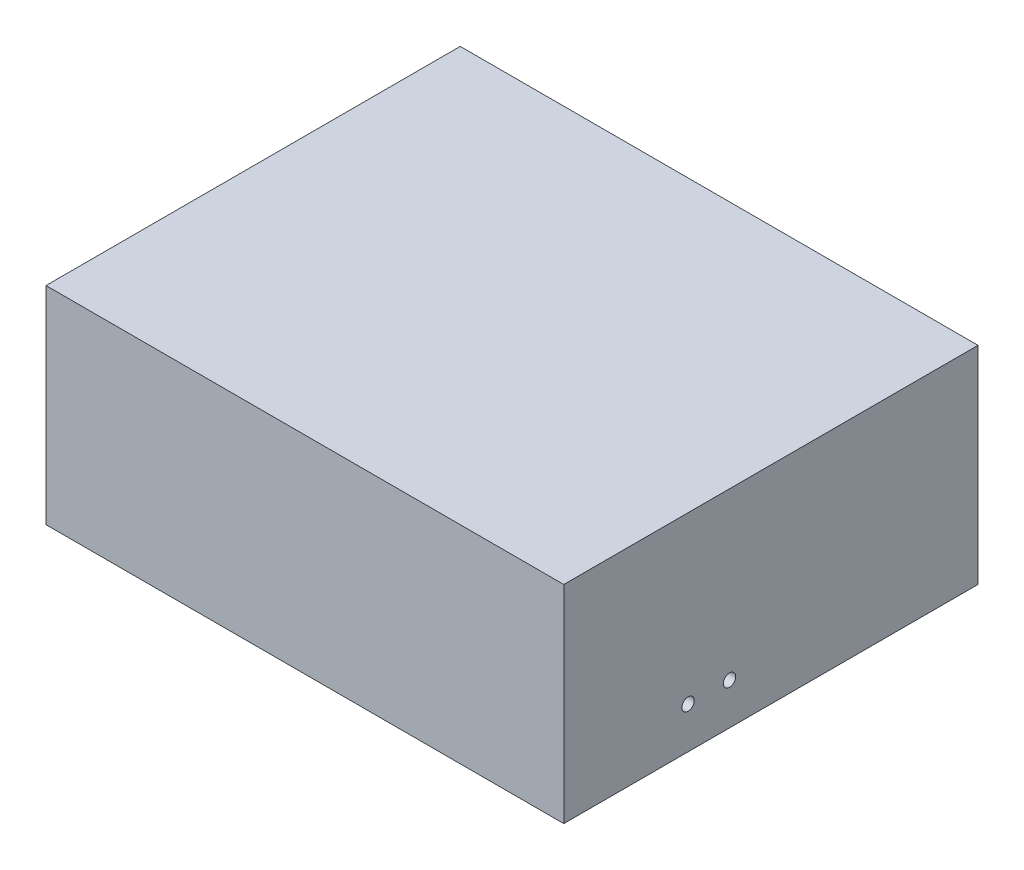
ISO-10303-21;
HEADER;
FILE_DESCRIPTION(('STEP AP214'),'2;1');
FILE_NAME('part.step','',(''),(''),'','','');
FILE_SCHEMA(('AUTOMOTIVE_DESIGN { 1 0 10303 214 1 1 1 1 }'));
ENDSEC;
DATA;
#1=APPLICATION_CONTEXT('core data for automotive mechanical design processes');
#2=APPLICATION_PROTOCOL_DEFINITION('international standard','automotive_design',2000,#1);
#3=PRODUCT_CONTEXT('',#1,'mechanical');
#4=PRODUCT('Part','Part','',(#3));
#5=PRODUCT_RELATED_PRODUCT_CATEGORY('part','',(#4));
#6=PRODUCT_DEFINITION_FORMATION('','',#4);
#7=PRODUCT_DEFINITION_CONTEXT('part definition',#1,'design');
#8=PRODUCT_DEFINITION('design','',#6,#7);
#9=PRODUCT_DEFINITION_SHAPE('','',#8);
#10=(LENGTH_UNIT() NAMED_UNIT(*) SI_UNIT(.MILLI.,.METRE.));
#11=(NAMED_UNIT(*) PLANE_ANGLE_UNIT() SI_UNIT($,.RADIAN.));
#12=(NAMED_UNIT(*) SI_UNIT($,.STERADIAN.) SOLID_ANGLE_UNIT());
#13=UNCERTAINTY_MEASURE_WITH_UNIT(LENGTH_MEASURE(1.E-05),#10,'distance_accuracy_value','');
#14=(GEOMETRIC_REPRESENTATION_CONTEXT(3) GLOBAL_UNCERTAINTY_ASSIGNED_CONTEXT((#13)) GLOBAL_UNIT_ASSIGNED_CONTEXT((#10,
#11,#12)) REPRESENTATION_CONTEXT('',''));
#15=CARTESIAN_POINT('',(0.,0.,0.));
#16=DIRECTION('',(0.,0.,1.));
#17=DIRECTION('',(1.,0.,0.));
#18=AXIS2_PLACEMENT_3D('',#15,#16,#17);
#19=CARTESIAN_POINT('',(125.,100.,-100.));
#20=DIRECTION('',(-1.,0.,0.));
#21=DIRECTION('',(0.,0.,1.));
#22=AXIS2_PLACEMENT_3D('',#19,#20,#21);
#23=PLANE('',#22);
#24=CARTESIAN_POINT('',(125.,20.,40.));
#25=DIRECTION('',(1.,0.,0.));
#26=DIRECTION('',(0.,0.,-1.));
#27=AXIS2_PLACEMENT_3D('',#24,#25,#26);
#28=CIRCLE('',#27,3.);
#29=CARTESIAN_POINT('',(125.,20.,37.));
#30=VERTEX_POINT('',#29);
#31=EDGE_CURVE('E139',#30,#30,#28,.T.);
#32=ORIENTED_EDGE('',*,*,#31,.F.);
#33=EDGE_LOOP('',(#32));
#34=FACE_BOUND('',#33,.T.);
#35=CARTESIAN_POINT('',(125.,20.,20.));
#36=DIRECTION('',(1.,0.,0.));
#37=DIRECTION('',(0.,0.,-1.));
#38=AXIS2_PLACEMENT_3D('',#35,#36,#37);
#39=CIRCLE('',#38,3.);
#40=CARTESIAN_POINT('',(125.,20.,17.));
#41=VERTEX_POINT('',#40);
#42=EDGE_CURVE('E133',#41,#41,#39,.T.);
#43=ORIENTED_EDGE('',*,*,#42,.F.);
#44=EDGE_LOOP('',(#43));
#45=FACE_BOUND('',#44,.T.);
#46=DIRECTION('',(0.,0.,-1.));
#47=VECTOR('',#46,1.);
#48=CARTESIAN_POINT('',(125.,0.,-100.));
#49=LINE('',#48,#47);
#50=CARTESIAN_POINT('',(125.,0.,100.));
#51=VERTEX_POINT('',#50);
#52=CARTESIAN_POINT('',(125.,0.,-100.));
#53=VERTEX_POINT('',#52);
#54=EDGE_CURVE('E95',#51,#53,#49,.T.);
#55=ORIENTED_EDGE('',*,*,#54,.T.);
#56=DIRECTION('',(0.,-1.,0.));
#57=VECTOR('',#56,1.);
#58=CARTESIAN_POINT('',(125.,100.,-100.));
#59=LINE('',#58,#57);
#60=CARTESIAN_POINT('',(125.,100.,-100.));
#61=VERTEX_POINT('',#60);
#62=EDGE_CURVE('E11',#61,#53,#59,.T.);
#63=ORIENTED_EDGE('',*,*,#62,.F.);
#64=DIRECTION('',(0.,0.,-1.));
#65=VECTOR('',#64,1.);
#66=CARTESIAN_POINT('',(125.,100.,-100.));
#67=LINE('',#66,#65);
#68=CARTESIAN_POINT('',(125.,100.,100.));
#69=VERTEX_POINT('',#68);
#70=EDGE_CURVE('E83',#69,#61,#67,.T.);
#71=ORIENTED_EDGE('',*,*,#70,.F.);
#72=DIRECTION('',(0.,-1.,0.));
#73=VECTOR('',#72,1.);
#74=CARTESIAN_POINT('',(125.,100.,100.));
#75=LINE('',#74,#73);
#76=EDGE_CURVE('E91',#69,#51,#75,.T.);
#77=ORIENTED_EDGE('',*,*,#76,.T.);
#78=EDGE_LOOP('',(#55,#63,#71,#77));
#79=FACE_BOUND('',#78,.T.);
#80=ADVANCED_FACE('F32',(#34,#45,#79),#23,.F.);
#81=CARTESIAN_POINT('',(-125.,100.,-100.));
#82=DIRECTION('',(0.,0.,1.));
#83=DIRECTION('',(1.,0.,0.));
#84=AXIS2_PLACEMENT_3D('',#81,#82,#83);
#85=PLANE('',#84);
#86=DIRECTION('',(-1.,0.,0.));
#87=VECTOR('',#86,1.);
#88=CARTESIAN_POINT('',(-125.,0.,-100.));
#89=LINE('',#88,#87);
#90=CARTESIAN_POINT('',(-125.,0.,-100.));
#91=VERTEX_POINT('',#90);
#92=EDGE_CURVE('E87',#53,#91,#89,.T.);
#93=ORIENTED_EDGE('',*,*,#92,.T.);
#94=DIRECTION('',(0.,-1.,0.));
#95=VECTOR('',#94,1.);
#96=CARTESIAN_POINT('',(-125.,100.,-100.));
#97=LINE('',#96,#95);
#98=CARTESIAN_POINT('',(-125.,100.,-100.));
#99=VERTEX_POINT('',#98);
#100=EDGE_CURVE('E40',#99,#91,#97,.T.);
#101=ORIENTED_EDGE('',*,*,#100,.F.);
#102=DIRECTION('',(-1.,0.,0.));
#103=VECTOR('',#102,1.);
#104=CARTESIAN_POINT('',(-125.,100.,-100.));
#105=LINE('',#104,#103);
#106=EDGE_CURVE('E78',#61,#99,#105,.T.);
#107=ORIENTED_EDGE('',*,*,#106,.F.);
#108=ORIENTED_EDGE('',*,*,#62,.T.);
#109=EDGE_LOOP('',(#93,#101,#107,#108));
#110=FACE_BOUND('',#109,.T.);
#111=ADVANCED_FACE('F86',(#110),#85,.F.);
#112=CARTESIAN_POINT('',(-125.,100.,-100.));
#113=DIRECTION('',(1.,0.,0.));
#114=DIRECTION('',(0.,0.,-1.));
#115=AXIS2_PLACEMENT_3D('',#112,#113,#114);
#116=PLANE('',#115);
#117=DIRECTION('',(0.,0.,1.));
#118=VECTOR('',#117,1.);
#119=CARTESIAN_POINT('',(-125.,0.,-100.));
#120=LINE('',#119,#118);
#121=CARTESIAN_POINT('',(-125.,0.,100.));
#122=VERTEX_POINT('',#121);
#123=EDGE_CURVE('E65',#91,#122,#120,.T.);
#124=ORIENTED_EDGE('',*,*,#123,.T.);
#125=DIRECTION('',(0.,-1.,0.));
#126=VECTOR('',#125,1.);
#127=CARTESIAN_POINT('',(-125.,100.,100.));
#128=LINE('',#127,#126);
#129=CARTESIAN_POINT('',(-125.,100.,100.));
#130=VERTEX_POINT('',#129);
#131=EDGE_CURVE('E88',#130,#122,#128,.T.);
#132=ORIENTED_EDGE('',*,*,#131,.F.);
#133=DIRECTION('',(0.,0.,1.));
#134=VECTOR('',#133,1.);
#135=CARTESIAN_POINT('',(-125.,100.,-100.));
#136=LINE('',#135,#134);
#137=EDGE_CURVE('E81',#99,#130,#136,.T.);
#138=ORIENTED_EDGE('',*,*,#137,.F.);
#139=ORIENTED_EDGE('',*,*,#100,.T.);
#140=EDGE_LOOP('',(#124,#132,#138,#139));
#141=FACE_BOUND('',#140,.T.);
#142=ADVANCED_FACE('F89',(#141),#116,.F.);
#143=CARTESIAN_POINT('',(-125.,100.,100.));
#144=DIRECTION('',(0.,0.,-1.));
#145=DIRECTION('',(-1.,0.,0.));
#146=AXIS2_PLACEMENT_3D('',#143,#144,#145);
#147=PLANE('',#146);
#148=DIRECTION('',(1.,0.,0.));
#149=VECTOR('',#148,1.);
#150=CARTESIAN_POINT('',(-125.,0.,100.));
#151=LINE('',#150,#149);
#152=EDGE_CURVE('E71',#122,#51,#151,.T.);
#153=ORIENTED_EDGE('',*,*,#152,.T.);
#154=ORIENTED_EDGE('',*,*,#76,.F.);
#155=DIRECTION('',(1.,0.,0.));
#156=VECTOR('',#155,1.);
#157=CARTESIAN_POINT('',(-125.,100.,100.));
#158=LINE('',#157,#156);
#159=EDGE_CURVE('E48',#130,#69,#158,.T.);
#160=ORIENTED_EDGE('',*,*,#159,.F.);
#161=ORIENTED_EDGE('',*,*,#131,.T.);
#162=EDGE_LOOP('',(#153,#154,#160,#161));
#163=FACE_BOUND('',#162,.T.);
#164=ADVANCED_FACE('F103',(#163),#147,.F.);
#165=CARTESIAN_POINT('',(0.,100.,0.));
#166=DIRECTION('',(0.,1.,0.));
#167=DIRECTION('',(0.,0.,1.));
#168=AXIS2_PLACEMENT_3D('',#165,#166,#167);
#169=PLANE('',#168);
#170=ORIENTED_EDGE('',*,*,#70,.T.);
#171=ORIENTED_EDGE('',*,*,#106,.T.);
#172=ORIENTED_EDGE('',*,*,#137,.T.);
#173=ORIENTED_EDGE('',*,*,#159,.T.);
#174=EDGE_LOOP('',(#170,#171,#172,#173));
#175=FACE_BOUND('',#174,.T.);
#176=ADVANCED_FACE('F79',(#175),#169,.T.);
#177=CARTESIAN_POINT('',(0.,0.,0.));
#178=DIRECTION('',(0.,1.,0.));
#179=DIRECTION('',(0.,0.,1.));
#180=AXIS2_PLACEMENT_3D('',#177,#178,#179);
#181=PLANE('',#180);
#182=CARTESIAN_POINT('',(105.,0.,80.));
#183=DIRECTION('',(0.,-1.,0.));
#184=DIRECTION('',(0.,0.,-1.));
#185=AXIS2_PLACEMENT_3D('',#182,#183,#184);
#186=CIRCLE('',#185,5.00000000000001);
#187=CARTESIAN_POINT('',(105.,0.,75.));
#188=VERTEX_POINT('',#187);
#189=EDGE_CURVE('E122',#188,#188,#186,.T.);
#190=ORIENTED_EDGE('',*,*,#189,.F.);
#191=EDGE_LOOP('',(#190));
#192=FACE_BOUND('',#191,.T.);
#193=CARTESIAN_POINT('',(-105.,0.,-80.));
#194=DIRECTION('',(0.,-1.,0.));
#195=DIRECTION('',(0.,0.,-1.));
#196=AXIS2_PLACEMENT_3D('',#193,#194,#195);
#197=CIRCLE('',#196,5.00000000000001);
#198=CARTESIAN_POINT('',(-105.,0.,-85.));
#199=VERTEX_POINT('',#198);
#200=EDGE_CURVE('E115',#199,#199,#197,.T.);
#201=ORIENTED_EDGE('',*,*,#200,.F.);
#202=EDGE_LOOP('',(#201));
#203=FACE_BOUND('',#202,.T.);
#204=CARTESIAN_POINT('',(105.,0.,-80.));
#205=DIRECTION('',(0.,-1.,0.));
#206=DIRECTION('',(0.,0.,-1.));
#207=AXIS2_PLACEMENT_3D('',#204,#205,#206);
#208=CIRCLE('',#207,5.00000000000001);
#209=CARTESIAN_POINT('',(105.,0.,-85.));
#210=VERTEX_POINT('',#209);
#211=EDGE_CURVE('E127',#210,#210,#208,.T.);
#212=ORIENTED_EDGE('',*,*,#211,.F.);
#213=EDGE_LOOP('',(#212));
#214=FACE_BOUND('',#213,.T.);
#215=CARTESIAN_POINT('',(-105.,0.,80.));
#216=DIRECTION('',(0.,-1.,0.));
#217=DIRECTION('',(0.,0.,-1.));
#218=AXIS2_PLACEMENT_3D('',#215,#216,#217);
#219=CIRCLE('',#218,5.00000000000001);
#220=CARTESIAN_POINT('',(-105.,0.,75.));
#221=VERTEX_POINT('',#220);
#222=EDGE_CURVE('E109',#221,#221,#219,.T.);
#223=ORIENTED_EDGE('',*,*,#222,.F.);
#224=EDGE_LOOP('',(#223));
#225=FACE_BOUND('',#224,.T.);
#226=ORIENTED_EDGE('',*,*,#54,.F.);
#227=ORIENTED_EDGE('',*,*,#152,.F.);
#228=ORIENTED_EDGE('',*,*,#123,.F.);
#229=ORIENTED_EDGE('',*,*,#92,.F.);
#230=EDGE_LOOP('',(#226,#227,#228,#229));
#231=FACE_BOUND('',#230,.T.);
#232=ADVANCED_FACE('F106',(#192,#203,#214,#225,#231),#181,.F.);
#233=CARTESIAN_POINT('',(-105.,5.,80.));
#234=DIRECTION('',(0.,-1.,0.));
#235=DIRECTION('',(0.,0.,-1.));
#236=AXIS2_PLACEMENT_3D('',#233,#234,#235);
#237=CYLINDRICAL_SURFACE('',#236,5.00000000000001);
#238=CARTESIAN_POINT('',(-105.,5.,80.));
#239=DIRECTION('',(0.,-1.,0.));
#240=DIRECTION('',(0.,0.,-1.));
#241=AXIS2_PLACEMENT_3D('',#238,#239,#240);
#242=CIRCLE('',#241,5.00000000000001);
#243=CARTESIAN_POINT('',(-105.,5.,75.));
#244=VERTEX_POINT('',#243);
#245=EDGE_CURVE('E98',#244,#244,#242,.T.);
#246=ORIENTED_EDGE('',*,*,#245,.F.);
#247=EDGE_LOOP('',(#246));
#248=FACE_BOUND('',#247,.T.);
#249=ORIENTED_EDGE('',*,*,#222,.T.);
#250=EDGE_LOOP('',(#249));
#251=FACE_BOUND('',#250,.T.);
#252=ADVANCED_FACE('F196',(#248,#251),#237,.F.);
#253=CARTESIAN_POINT('',(-105.,5.,80.));
#254=DIRECTION('',(0.,-1.,0.));
#255=DIRECTION('',(0.,0.,-1.));
#256=AXIS2_PLACEMENT_3D('',#253,#254,#255);
#257=PLANE('',#256);
#258=ORIENTED_EDGE('',*,*,#245,.T.);
#259=EDGE_LOOP('',(#258));
#260=FACE_BOUND('',#259,.T.);
#261=ADVANCED_FACE('F181',(#260),#257,.T.);
#262=CARTESIAN_POINT('',(105.,5.,-80.));
#263=DIRECTION('',(0.,-1.,0.));
#264=DIRECTION('',(0.,0.,-1.));
#265=AXIS2_PLACEMENT_3D('',#262,#263,#264);
#266=CYLINDRICAL_SURFACE('',#265,5.00000000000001);
#267=CARTESIAN_POINT('',(105.,5.,-80.));
#268=DIRECTION('',(0.,-1.,0.));
#269=DIRECTION('',(0.,0.,-1.));
#270=AXIS2_PLACEMENT_3D('',#267,#268,#269);
#271=CIRCLE('',#270,5.00000000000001);
#272=CARTESIAN_POINT('',(105.,5.,-85.));
#273=VERTEX_POINT('',#272);
#274=EDGE_CURVE('E119',#273,#273,#271,.T.);
#275=ORIENTED_EDGE('',*,*,#274,.F.);
#276=EDGE_LOOP('',(#275));
#277=FACE_BOUND('',#276,.T.);
#278=ORIENTED_EDGE('',*,*,#211,.T.);
#279=EDGE_LOOP('',(#278));
#280=FACE_BOUND('',#279,.T.);
#281=ADVANCED_FACE('F178',(#277,#280),#266,.F.);
#282=CARTESIAN_POINT('',(105.,5.,-80.));
#283=DIRECTION('',(0.,-1.,0.));
#284=DIRECTION('',(0.,0.,-1.));
#285=AXIS2_PLACEMENT_3D('',#282,#283,#284);
#286=PLANE('',#285);
#287=ORIENTED_EDGE('',*,*,#274,.T.);
#288=EDGE_LOOP('',(#287));
#289=FACE_BOUND('',#288,.T.);
#290=ADVANCED_FACE('F174',(#289),#286,.T.);
#291=CARTESIAN_POINT('',(-105.,5.,-80.));
#292=DIRECTION('',(0.,-1.,0.));
#293=DIRECTION('',(0.,0.,-1.));
#294=AXIS2_PLACEMENT_3D('',#291,#292,#293);
#295=CYLINDRICAL_SURFACE('',#294,5.00000000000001);
#296=CARTESIAN_POINT('',(-105.,5.,-80.));
#297=DIRECTION('',(0.,-1.,0.));
#298=DIRECTION('',(0.,0.,-1.));
#299=AXIS2_PLACEMENT_3D('',#296,#297,#298);
#300=CIRCLE('',#299,5.00000000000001);
#301=CARTESIAN_POINT('',(-105.,5.,-85.));
#302=VERTEX_POINT('',#301);
#303=EDGE_CURVE('E118',#302,#302,#300,.T.);
#304=ORIENTED_EDGE('',*,*,#303,.F.);
#305=EDGE_LOOP('',(#304));
#306=FACE_BOUND('',#305,.T.);
#307=ORIENTED_EDGE('',*,*,#200,.T.);
#308=EDGE_LOOP('',(#307));
#309=FACE_BOUND('',#308,.T.);
#310=ADVANCED_FACE('F177',(#306,#309),#295,.F.);
#311=CARTESIAN_POINT('',(-105.,5.,-80.));
#312=DIRECTION('',(0.,-1.,0.));
#313=DIRECTION('',(0.,0.,-1.));
#314=AXIS2_PLACEMENT_3D('',#311,#312,#313);
#315=PLANE('',#314);
#316=ORIENTED_EDGE('',*,*,#303,.T.);
#317=EDGE_LOOP('',(#316));
#318=FACE_BOUND('',#317,.T.);
#319=ADVANCED_FACE('F186',(#318),#315,.T.);
#320=CARTESIAN_POINT('',(105.,5.,80.));
#321=DIRECTION('',(0.,-1.,0.));
#322=DIRECTION('',(0.,0.,-1.));
#323=AXIS2_PLACEMENT_3D('',#320,#321,#322);
#324=CYLINDRICAL_SURFACE('',#323,5.00000000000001);
#325=CARTESIAN_POINT('',(105.,5.,80.));
#326=DIRECTION('',(0.,-1.,0.));
#327=DIRECTION('',(0.,0.,-1.));
#328=AXIS2_PLACEMENT_3D('',#325,#326,#327);
#329=CIRCLE('',#328,5.00000000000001);
#330=CARTESIAN_POINT('',(105.,5.,75.));
#331=VERTEX_POINT('',#330);
#332=EDGE_CURVE('E112',#331,#331,#329,.T.);
#333=ORIENTED_EDGE('',*,*,#332,.F.);
#334=EDGE_LOOP('',(#333));
#335=FACE_BOUND('',#334,.T.);
#336=ORIENTED_EDGE('',*,*,#189,.T.);
#337=EDGE_LOOP('',(#336));
#338=FACE_BOUND('',#337,.T.);
#339=ADVANCED_FACE('F169',(#335,#338),#324,.F.);
#340=CARTESIAN_POINT('',(105.,5.,80.));
#341=DIRECTION('',(0.,-1.,0.));
#342=DIRECTION('',(0.,0.,-1.));
#343=AXIS2_PLACEMENT_3D('',#340,#341,#342);
#344=PLANE('',#343);
#345=ORIENTED_EDGE('',*,*,#332,.T.);
#346=EDGE_LOOP('',(#345));
#347=FACE_BOUND('',#346,.T.);
#348=ADVANCED_FACE('F160',(#347),#344,.T.);
#349=CARTESIAN_POINT('',(115.,20.,20.));
#350=DIRECTION('',(1.,0.,0.));
#351=DIRECTION('',(0.,0.,-1.));
#352=AXIS2_PLACEMENT_3D('',#349,#350,#351);
#353=CYLINDRICAL_SURFACE('',#352,3.);
#354=CARTESIAN_POINT('',(115.,20.,20.));
#355=DIRECTION('',(1.,0.,0.));
#356=DIRECTION('',(0.,0.,-1.));
#357=AXIS2_PLACEMENT_3D('',#354,#355,#356);
#358=CIRCLE('',#357,3.);
#359=CARTESIAN_POINT('',(115.,20.,17.));
#360=VERTEX_POINT('',#359);
#361=EDGE_CURVE('E136',#360,#360,#358,.T.);
#362=ORIENTED_EDGE('',*,*,#361,.F.);
#363=EDGE_LOOP('',(#362));
#364=FACE_BOUND('',#363,.T.);
#365=ORIENTED_EDGE('',*,*,#42,.T.);
#366=EDGE_LOOP('',(#365));
#367=FACE_BOUND('',#366,.T.);
#368=ADVANCED_FACE('F158',(#364,#367),#353,.F.);
#369=CARTESIAN_POINT('',(115.,20.,20.));
#370=DIRECTION('',(1.,0.,0.));
#371=DIRECTION('',(0.,0.,-1.));
#372=AXIS2_PLACEMENT_3D('',#369,#370,#371);
#373=PLANE('',#372);
#374=ORIENTED_EDGE('',*,*,#361,.T.);
#375=EDGE_LOOP('',(#374));
#376=FACE_BOUND('',#375,.T.);
#377=ADVANCED_FACE('F150',(#376),#373,.T.);
#378=CARTESIAN_POINT('',(115.,20.,40.));
#379=DIRECTION('',(1.,0.,0.));
#380=DIRECTION('',(0.,0.,-1.));
#381=AXIS2_PLACEMENT_3D('',#378,#379,#380);
#382=CYLINDRICAL_SURFACE('',#381,3.);
#383=CARTESIAN_POINT('',(115.,20.,40.));
#384=DIRECTION('',(1.,0.,0.));
#385=DIRECTION('',(0.,0.,-1.));
#386=AXIS2_PLACEMENT_3D('',#383,#384,#385);
#387=CIRCLE('',#386,3.);
#388=CARTESIAN_POINT('',(115.,20.,37.));
#389=VERTEX_POINT('',#388);
#390=EDGE_CURVE('E130',#389,#389,#387,.T.);
#391=ORIENTED_EDGE('',*,*,#390,.F.);
#392=EDGE_LOOP('',(#391));
#393=FACE_BOUND('',#392,.T.);
#394=ORIENTED_EDGE('',*,*,#31,.T.);
#395=EDGE_LOOP('',(#394));
#396=FACE_BOUND('',#395,.T.);
#397=ADVANCED_FACE('F147',(#393,#396),#382,.F.);
#398=CARTESIAN_POINT('',(115.,20.,40.));
#399=DIRECTION('',(1.,0.,0.));
#400=DIRECTION('',(0.,0.,-1.));
#401=AXIS2_PLACEMENT_3D('',#398,#399,#400);
#402=PLANE('',#401);
#403=ORIENTED_EDGE('',*,*,#390,.T.);
#404=EDGE_LOOP('',(#403));
#405=FACE_BOUND('',#404,.T.);
#406=ADVANCED_FACE('F145',(#405),#402,.T.);
#407=CLOSED_SHELL('',(#80,#111,#142,#164,#176,#232,#252,#261,#281,#290,#310,#319,#339,#348,#368,
#377,#397,#406));
#408=MANIFOLD_SOLID_BREP('B2',#407);
#409=ADVANCED_BREP_SHAPE_REPRESENTATION('',(#18,#408),#14);
#410=SHAPE_DEFINITION_REPRESENTATION(#9,#409);
ENDSEC;
END-ISO-10303-21;
